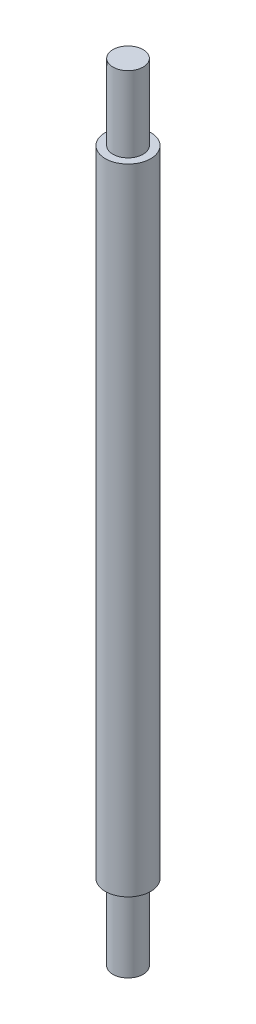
from build123d import *


with BuildPart() as part:
    # Sketch1 → Revolve1 (revolve)
    with BuildSketch(Plane.XY, mode=Mode.PRIVATE) as revolve1_sk:
        Polygon((0, 52), (0, -52), (2, -52), (2, -42), (3, -42), (3, 42), (2, 42), (2, 52), align=None)
    revolve(revolve1_sk.sketch.rotate(Axis((0, 0, 0), (0, 1, 0)), 90), axis=Axis((0, 0, 0), (0, 1, 0)))


solid = part.part
